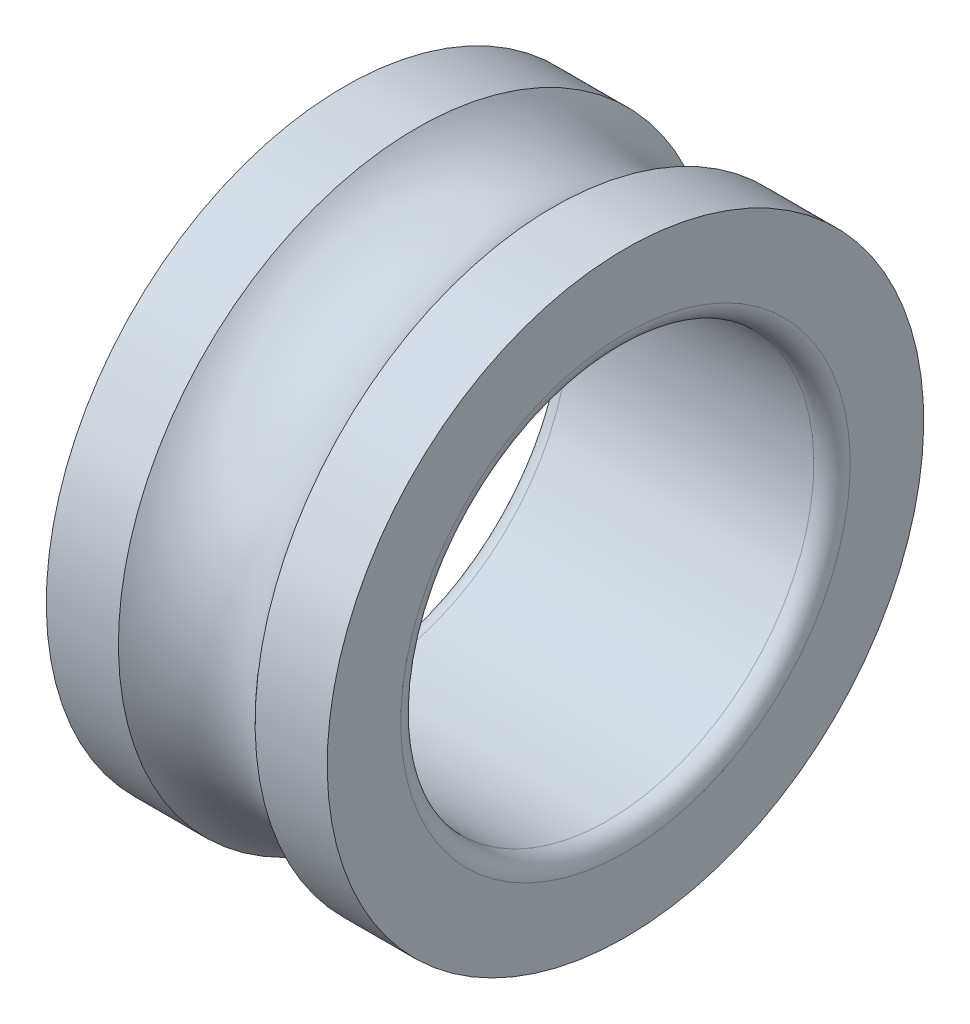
from build123d import *


with BuildPart() as part:
    # Esquisse1 → R_volution1 (revolve)
    with BuildSketch(Plane.XY, mode=Mode.PRIVATE) as r_volution1_sk:
        with BuildLine():
            Line((1.1, 12.5), (15.9, 12.5))
            ThreePointArc((15.9, 12.5), (16.677817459, 12.822182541), (17, 13.6))
            Line((17, 13.6), (17, 18.05))
            Line((17, 18.05), (12.636725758, 18.05))
            ThreePointArc((12.636725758, 18.05), (8.5, 16.2), (4.363274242, 18.05))
            Line((4.363274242, 18.05), (0, 18.05))
            Line((0, 18.05), (0, 13.6))
            ThreePointArc((0, 13.6), (0.322182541, 12.822182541), (1.1, 12.5))
        make_face()
    revolve(r_volution1_sk.sketch.rotate(Axis((0, 0, 0), (1, 0, 0)), 180), axis=Axis((0, 0, 0), (1, 0, 0)))


solid = part.part
